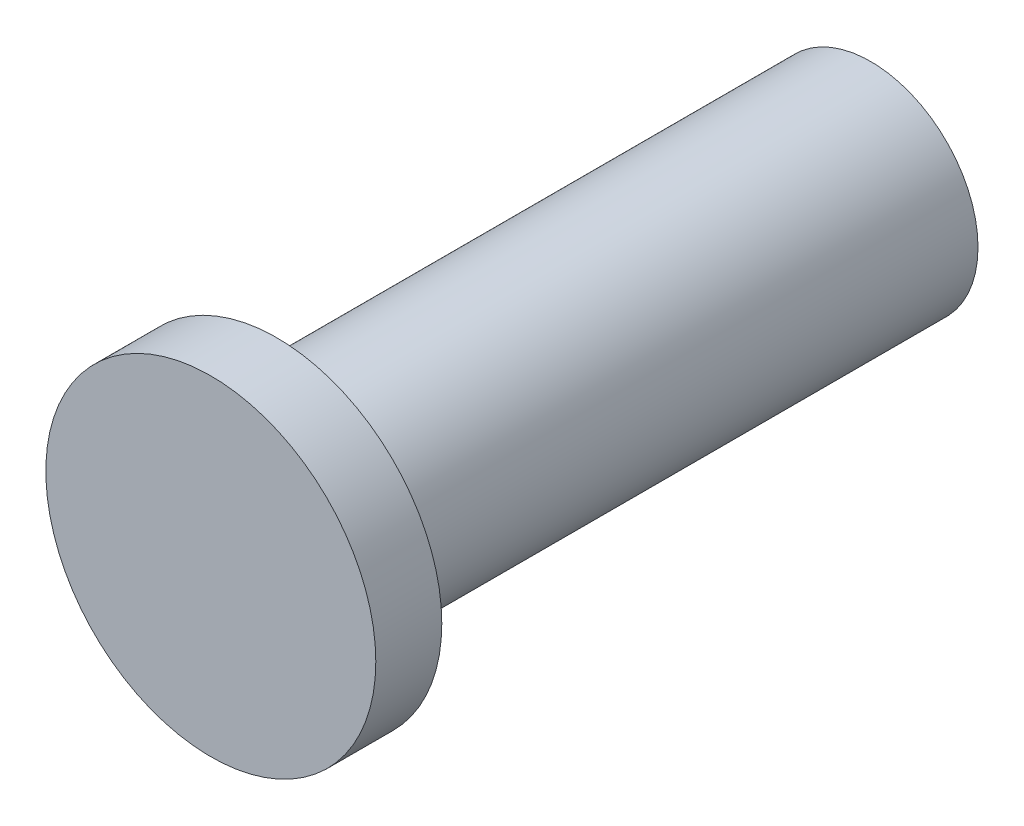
ISO-10303-21;
HEADER;
FILE_DESCRIPTION(('STEP AP214'),'2;1');
FILE_NAME('part.step','',(''),(''),'','','');
FILE_SCHEMA(('AUTOMOTIVE_DESIGN { 1 0 10303 214 1 1 1 1 }'));
ENDSEC;
DATA;
#1=APPLICATION_CONTEXT('core data for automotive mechanical design processes');
#2=APPLICATION_PROTOCOL_DEFINITION('international standard','automotive_design',2000,#1);
#3=PRODUCT_CONTEXT('',#1,'mechanical');
#4=PRODUCT('Part','Part','',(#3));
#5=PRODUCT_RELATED_PRODUCT_CATEGORY('part','',(#4));
#6=PRODUCT_DEFINITION_FORMATION('','',#4);
#7=PRODUCT_DEFINITION_CONTEXT('part definition',#1,'design');
#8=PRODUCT_DEFINITION('design','',#6,#7);
#9=PRODUCT_DEFINITION_SHAPE('','',#8);
#10=(LENGTH_UNIT() NAMED_UNIT(*) SI_UNIT(.MILLI.,.METRE.));
#11=(NAMED_UNIT(*) PLANE_ANGLE_UNIT() SI_UNIT($,.RADIAN.));
#12=(NAMED_UNIT(*) SI_UNIT($,.STERADIAN.) SOLID_ANGLE_UNIT());
#13=UNCERTAINTY_MEASURE_WITH_UNIT(LENGTH_MEASURE(1.E-05),#10,'distance_accuracy_value','');
#14=(GEOMETRIC_REPRESENTATION_CONTEXT(3) GLOBAL_UNCERTAINTY_ASSIGNED_CONTEXT((#13)) GLOBAL_UNIT_ASSIGNED_CONTEXT((#10,
#11,#12)) REPRESENTATION_CONTEXT('',''));
#15=CARTESIAN_POINT('',(0.,0.,0.));
#16=DIRECTION('',(0.,0.,1.));
#17=DIRECTION('',(1.,0.,0.));
#18=AXIS2_PLACEMENT_3D('',#15,#16,#17);
#19=CARTESIAN_POINT('',(0.,0.,20.));
#20=DIRECTION('',(0.,0.,-1.));
#21=DIRECTION('',(-1.,0.,0.));
#22=AXIS2_PLACEMENT_3D('',#19,#20,#21);
#23=CYLINDRICAL_SURFACE('',#22,3.25);
#24=CARTESIAN_POINT('',(0.,0.,0.));
#25=DIRECTION('',(0.,0.,1.));
#26=DIRECTION('',(1.,0.,0.));
#27=AXIS2_PLACEMENT_3D('',#24,#25,#26);
#28=CIRCLE('',#27,3.25);
#29=CARTESIAN_POINT('',(3.25,0.,0.));
#30=VERTEX_POINT('',#29);
#31=EDGE_CURVE('E50',#30,#30,#28,.T.);
#32=ORIENTED_EDGE('',*,*,#31,.T.);
#33=EDGE_LOOP('',(#32));
#34=FACE_BOUND('',#33,.T.);
#35=CARTESIAN_POINT('',(0.,0.,18.));
#36=DIRECTION('',(0.,0.,1.));
#37=DIRECTION('',(1.,0.,0.));
#38=AXIS2_PLACEMENT_3D('',#35,#36,#37);
#39=CIRCLE('',#38,3.25);
#40=CARTESIAN_POINT('',(3.25,0.,18.));
#41=VERTEX_POINT('',#40);
#42=EDGE_CURVE('E10',#41,#41,#39,.T.);
#43=ORIENTED_EDGE('',*,*,#42,.F.);
#44=EDGE_LOOP('',(#43));
#45=FACE_BOUND('',#44,.T.);
#46=ADVANCED_FACE('F43',(#34,#45),#23,.T.);
#47=CARTESIAN_POINT('',(0.,0.,0.));
#48=DIRECTION('',(0.,0.,1.));
#49=DIRECTION('',(1.,0.,0.));
#50=AXIS2_PLACEMENT_3D('',#47,#48,#49);
#51=PLANE('',#50);
#52=ORIENTED_EDGE('',*,*,#31,.F.);
#53=EDGE_LOOP('',(#52));
#54=FACE_BOUND('',#53,.T.);
#55=ADVANCED_FACE('F72',(#54),#51,.F.);
#56=CARTESIAN_POINT('',(0.,0.,18.));
#57=DIRECTION('',(0.,0.,1.));
#58=DIRECTION('',(1.,0.,0.));
#59=AXIS2_PLACEMENT_3D('',#56,#57,#58);
#60=CYLINDRICAL_SURFACE('',#59,5.);
#61=CARTESIAN_POINT('',(0.,0.,18.));
#62=DIRECTION('',(0.,0.,1.));
#63=DIRECTION('',(1.,0.,0.));
#64=AXIS2_PLACEMENT_3D('',#61,#62,#63);
#65=CIRCLE('',#64,5.);
#66=CARTESIAN_POINT('',(5.,0.,18.));
#67=VERTEX_POINT('',#66);
#68=EDGE_CURVE('E55',#67,#67,#65,.T.);
#69=ORIENTED_EDGE('',*,*,#68,.T.);
#70=EDGE_LOOP('',(#69));
#71=FACE_BOUND('',#70,.T.);
#72=CARTESIAN_POINT('',(0.,0.,20.));
#73=DIRECTION('',(0.,0.,1.));
#74=DIRECTION('',(1.,0.,0.));
#75=AXIS2_PLACEMENT_3D('',#72,#73,#74);
#76=CIRCLE('',#75,5.);
#77=CARTESIAN_POINT('',(5.,0.,20.));
#78=VERTEX_POINT('',#77);
#79=EDGE_CURVE('E60',#78,#78,#76,.T.);
#80=ORIENTED_EDGE('',*,*,#79,.F.);
#81=EDGE_LOOP('',(#80));
#82=FACE_BOUND('',#81,.T.);
#83=ADVANCED_FACE('F69',(#71,#82),#60,.T.);
#84=CARTESIAN_POINT('',(0.,0.,18.));
#85=DIRECTION('',(0.,0.,1.));
#86=DIRECTION('',(1.,0.,0.));
#87=AXIS2_PLACEMENT_3D('',#84,#85,#86);
#88=PLANE('',#87);
#89=ORIENTED_EDGE('',*,*,#42,.T.);
#90=EDGE_LOOP('',(#89));
#91=FACE_BOUND('',#90,.T.);
#92=ORIENTED_EDGE('',*,*,#68,.F.);
#93=EDGE_LOOP('',(#92));
#94=FACE_BOUND('',#93,.T.);
#95=ADVANCED_FACE('F71',(#91,#94),#88,.F.);
#96=CARTESIAN_POINT('',(0.,0.,20.));
#97=DIRECTION('',(0.,0.,1.));
#98=DIRECTION('',(1.,0.,0.));
#99=AXIS2_PLACEMENT_3D('',#96,#97,#98);
#100=PLANE('',#99);
#101=ORIENTED_EDGE('',*,*,#79,.T.);
#102=EDGE_LOOP('',(#101));
#103=FACE_BOUND('',#102,.T.);
#104=ADVANCED_FACE('F67',(#103),#100,.T.);
#105=CLOSED_SHELL('',(#46,#55,#83,#95,#104));
#106=MANIFOLD_SOLID_BREP('B2',#105);
#107=ADVANCED_BREP_SHAPE_REPRESENTATION('',(#18,#106),#14);
#108=SHAPE_DEFINITION_REPRESENTATION(#9,#107);
ENDSEC;
END-ISO-10303-21;
